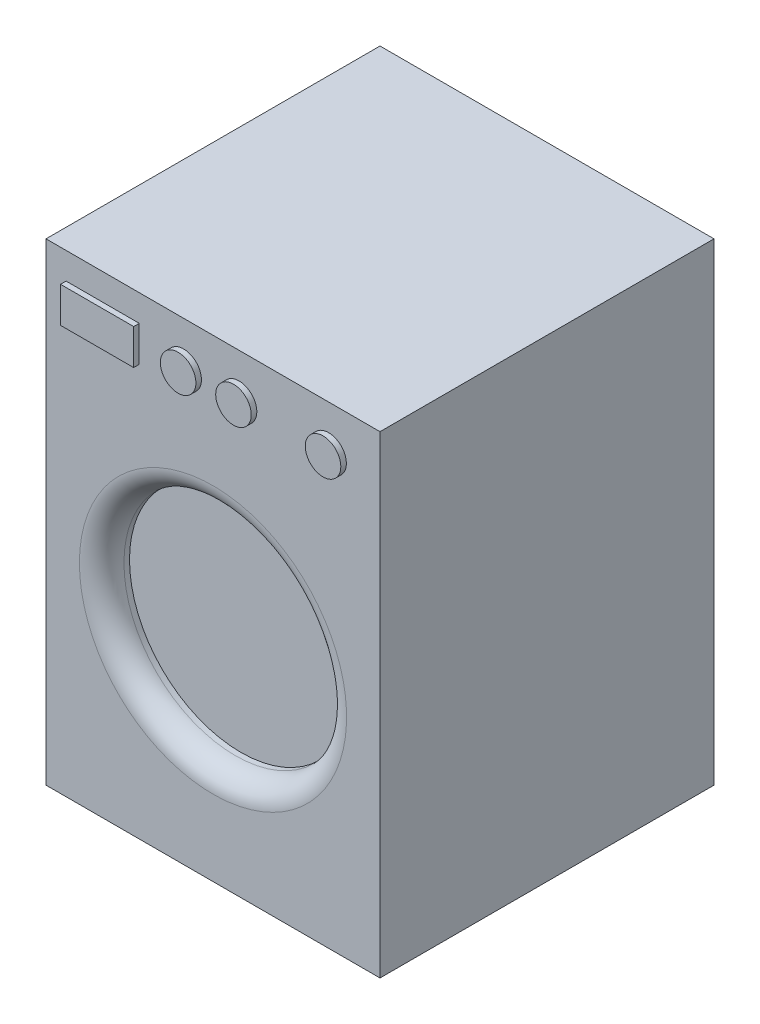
from build123d import *

# Parameters (mm, degrees)
ESQUISSE1_W             = 600
ESQUISSE1_H             = 600
BOSS_EXTRU_1_DEPTH      = 850
ESQUISSE2_R             = 200
ENL_V_MAT_EXTRU_1_DEPTH = 50
CONG_1_R                = 40
ESQUISSE3_R             = 31.929504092
ESQUISSE3_W             = 131.402189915
ESQUISSE3_H             = 63.859008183
BOSS_EXTRU_2_DEPTH      = 10


with BuildPart() as part:
    # Esquisse1 → Boss.-Extru.1 (new body)
    with BuildSketch(Plane(origin=(0, 0, 0), x_dir=(1, 0, 0), z_dir=(0, 1, 0))):
        Rectangle(ESQUISSE1_W, ESQUISSE1_H)
    extrude(amount=BOSS_EXTRU_1_DEPTH)

    # Esquisse2 → Enl_v. mat.-Extru.1 (cut)
    with BuildSketch(Plane.XY.offset(300)):
        with Locations((0, 375.977513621)):
            Circle(ESQUISSE2_R)
    extrude(amount=-ENL_V_MAT_EXTRU_1_DEPTH, mode=Mode.SUBTRACT)

    # Cong_1
    cong_1_edges = [part.edges().sort_by_distance(p)[0] for p in [
        (-200, 375.977513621, 300),
    ]]
    fillet(cong_1_edges, radius=CONG_1_R)

    # Esquisse3 → Boss.-Extru.2 (add)
    with BuildSketch(Plane.XY.offset(300)):
        with Locations(Location((-52.701240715, 770.356504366, 0), (0, 0, 180))):
            Circle(ESQUISSE3_R)
        with Locations(Location((46.771445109, 770.356504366, 0), (0, 0, 180))):
            Circle(ESQUISSE3_R)
        with Locations(Location((207.647023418, 770.356504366, 0), (0, 0, 180))):
            Circle(ESQUISSE3_R)
        with Locations((-198.226095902, 770.356504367)):
            Rectangle(ESQUISSE3_W, ESQUISSE3_H)
    extrude(amount=BOSS_EXTRU_2_DEPTH)


solid = part.part
